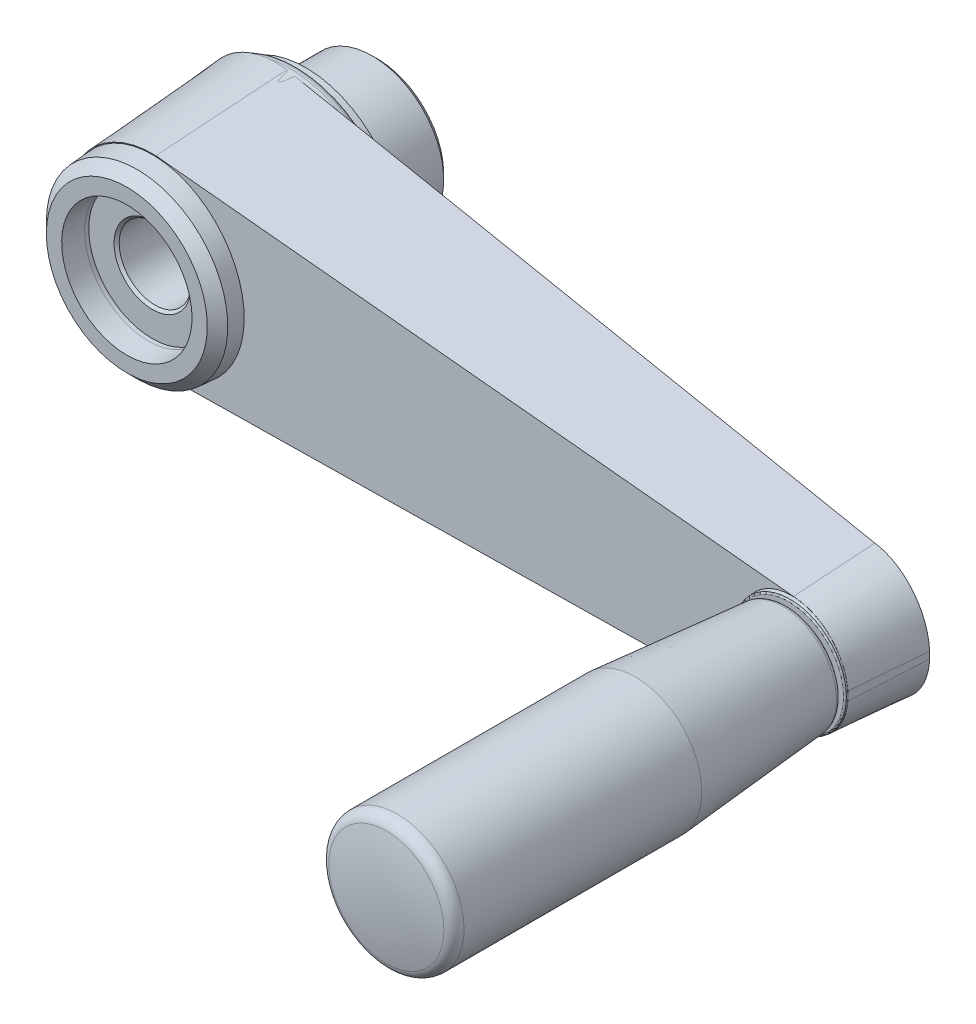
ISO-10303-21;
HEADER;
FILE_DESCRIPTION(('STEP AP214'),'2;1');
FILE_NAME('part.step','',(''),(''),'','','');
FILE_SCHEMA(('AUTOMOTIVE_DESIGN { 1 0 10303 214 1 1 1 1 }'));
ENDSEC;
DATA;
#1=APPLICATION_CONTEXT('core data for automotive mechanical design processes');
#2=APPLICATION_PROTOCOL_DEFINITION('international standard','automotive_design',2000,#1);
#3=PRODUCT_CONTEXT('',#1,'mechanical');
#4=PRODUCT('Part','Part','',(#3));
#5=PRODUCT_RELATED_PRODUCT_CATEGORY('part','',(#4));
#6=PRODUCT_DEFINITION_FORMATION('','',#4);
#7=PRODUCT_DEFINITION_CONTEXT('part definition',#1,'design');
#8=PRODUCT_DEFINITION('design','',#6,#7);
#9=PRODUCT_DEFINITION_SHAPE('','',#8);
#10=(LENGTH_UNIT() NAMED_UNIT(*) SI_UNIT(.MILLI.,.METRE.));
#11=(NAMED_UNIT(*) PLANE_ANGLE_UNIT() SI_UNIT($,.RADIAN.));
#12=(NAMED_UNIT(*) SI_UNIT($,.STERADIAN.) SOLID_ANGLE_UNIT());
#13=UNCERTAINTY_MEASURE_WITH_UNIT(LENGTH_MEASURE(1.E-05),#10,'distance_accuracy_value','');
#14=(GEOMETRIC_REPRESENTATION_CONTEXT(3) GLOBAL_UNCERTAINTY_ASSIGNED_CONTEXT((#13)) GLOBAL_UNIT_ASSIGNED_CONTEXT((#10,
#11,#12)) REPRESENTATION_CONTEXT('',''));
#15=CARTESIAN_POINT('',(0.,0.,0.));
#16=DIRECTION('',(0.,0.,1.));
#17=DIRECTION('',(1.,0.,0.));
#18=AXIS2_PLACEMENT_3D('',#15,#16,#17);
#19=CARTESIAN_POINT('',(0.,0.,49.));
#20=DIRECTION('',(0.,0.,1.));
#21=DIRECTION('',(-1.,0.,0.));
#22=AXIS2_PLACEMENT_3D('',#19,#20,#21);
#23=PLANE('',#22);
#24=CARTESIAN_POINT('',(0.,0.,49.));
#25=DIRECTION('',(0.,0.,1.));
#26=DIRECTION('',(-1.,0.,0.));
#27=AXIS2_PLACEMENT_3D('',#24,#25,#26);
#28=CIRCLE('',#27,15.7499999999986);
#29=CARTESIAN_POINT('',(-15.7499999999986,0.,49.));
#30=VERTEX_POINT('',#29);
#31=EDGE_CURVE('E125',#30,#30,#28,.T.);
#32=ORIENTED_EDGE('',*,*,#31,.T.);
#33=EDGE_LOOP('',(#32));
#34=FACE_BOUND('',#33,.T.);
#35=CARTESIAN_POINT('',(0.,0.,49.));
#36=DIRECTION('',(0.,0.,1.));
#37=DIRECTION('',(0.,-1.,0.));
#38=AXIS2_PLACEMENT_3D('',#35,#36,#37);
#39=CIRCLE('',#38,12.75);
#40=CARTESIAN_POINT('',(0.,-12.75,49.));
#41=VERTEX_POINT('',#40);
#42=EDGE_CURVE('E691',#41,#41,#39,.T.);
#43=ORIENTED_EDGE('',*,*,#42,.F.);
#44=EDGE_LOOP('',(#43));
#45=FACE_BOUND('',#44,.T.);
#46=ADVANCED_FACE('F14',(#34,#45),#23,.T.);
#47=CARTESIAN_POINT('',(-20.1321366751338,-20.,15.3848281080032));
#48=DIRECTION('',(-0.114070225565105,0.,0.993472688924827));
#49=DIRECTION('',(-0.993472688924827,0.,-0.114070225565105));
#50=AXIS2_PLACEMENT_3D('',#47,#48,#49);
#51=PLANE('',#50);
#52=DIRECTION('',(0.991730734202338,0.0591922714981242,0.113870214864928));
#53=VECTOR('',#52,1.);
#54=CARTESIAN_POINT('',(-20.0633459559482,-21.1677415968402,15.3927266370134));
#55=LINE('',#54,#53);
#56=CARTESIAN_POINT('',(129.969630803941,-12.2128989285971,32.6194664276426));
#57=VERTEX_POINT('',#56);
#58=CARTESIAN_POINT('',(1.75271123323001,-19.8656321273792,17.8976395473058));
#59=VERTEX_POINT('',#58);
#60=EDGE_CURVE('E328',#57,#59,#55,.F.);
#61=ORIENTED_EDGE('',*,*,#60,.T.);
#62=CARTESIAN_POINT('',(-0.172677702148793,0.,17.6765669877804));
#63=DIRECTION('',(-0.114070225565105,0.,0.993472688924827));
#64=DIRECTION('',(-0.993472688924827,0.,-0.114070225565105));
#65=AXIS2_PLACEMENT_3D('',#62,#63,#64);
#66=ELLIPSE('',#65,20.0905965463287,19.9587120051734);
#67=CARTESIAN_POINT('',(1.75271123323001,19.8656321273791,17.8976395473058));
#68=VERTEX_POINT('',#67);
#69=EDGE_CURVE('E212',#59,#68,#66,.T.);
#70=ORIENTED_EDGE('',*,*,#69,.T.);
#71=DIRECTION('',(-0.991730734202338,0.0591922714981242,-0.113870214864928));
#72=VECTOR('',#71,1.);
#73=CARTESIAN_POINT('',(-17.7152341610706,21.0275925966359,15.6623361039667));
#74=LINE('',#73,#72);
#75=CARTESIAN_POINT('',(129.969630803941,12.2128989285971,32.6194664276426));
#76=VERTEX_POINT('',#75);
#77=EDGE_CURVE('E324',#68,#76,#74,.F.);
#78=ORIENTED_EDGE('',*,*,#77,.T.);
#79=CARTESIAN_POINT('',(129.901938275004,0.,32.6116939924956));
#80=DIRECTION('',(-0.114070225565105,0.,0.993472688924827));
#81=DIRECTION('',(-0.993472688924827,0.,-0.114070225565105));
#82=AXIS2_PLACEMENT_3D('',#79,#80,#81);
#83=ELLIPSE('',#82,12.2937251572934,12.2130865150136);
#84=CARTESIAN_POINT('',(142.097777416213,0.656184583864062,34.0120164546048));
#85=VERTEX_POINT('',#84);
#86=EDGE_CURVE('E185',#76,#85,#83,.F.);
#87=ORIENTED_EDGE('',*,*,#86,.T.);
#88=DIRECTION('',(0.,1.,0.));
#89=VECTOR('',#88,1.);
#90=CARTESIAN_POINT('',(142.097777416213,-20.,34.0120164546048));
#91=LINE('',#90,#89);
#92=CARTESIAN_POINT('',(142.097777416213,-0.656184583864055,34.0120164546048));
#93=VERTEX_POINT('',#92);
#94=EDGE_CURVE('E311',#93,#85,#91,.T.);
#95=ORIENTED_EDGE('',*,*,#94,.F.);
#96=EDGE_CURVE('E351',#93,#57,#83,.F.);
#97=ORIENTED_EDGE('',*,*,#96,.T.);
#98=EDGE_LOOP('',(#61,#70,#78,#87,#95,#97));
#99=FACE_BOUND('',#98,.T.);
#100=ADVANCED_FACE('F151',(#99),#51,.F.);
#101=CARTESIAN_POINT('',(0.,0.,15.3848281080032));
#102=DIRECTION('',(0.,0.,-1.));
#103=DIRECTION('',(0.,1.,0.));
#104=AXIS2_PLACEMENT_3D('',#101,#102,#103);
#105=CONICAL_SURFACE('',#104,20.1321,0.0698131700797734);
#106=CARTESIAN_POINT('',(-0.051062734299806,0.,43.2844621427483));
#107=DIRECTION('',(-0.0401317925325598,0.,0.999194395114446));
#108=DIRECTION('',(-0.999194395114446,0.,-0.0401317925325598));
#109=AXIS2_PLACEMENT_3D('',#106,#107,#108);
#110=ELLIPSE('',#109,18.1958261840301,18.1810958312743);
#111=CARTESIAN_POINT('',(-0.0490638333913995,18.1810957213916,43.2845424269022));
#112=VERTEX_POINT('',#111);
#113=CARTESIAN_POINT('',(-18.0845323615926,2.31274383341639,42.5601631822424));
#114=VERTEX_POINT('',#113);
#115=EDGE_CURVE('E309',#112,#114,#110,.T.);
#116=ORIENTED_EDGE('',*,*,#115,.F.);
#117=CARTESIAN_POINT('',(-0.0586959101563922,17.7848123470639,48.9512203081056));
#118=CARTESIAN_POINT('',(-0.0492354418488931,18.1760435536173,43.3568222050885));
#119=CARTESIAN_POINT('',(-0.0396138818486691,18.5672664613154,37.762423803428));
#120=CARTESIAN_POINT('',(-0.0200485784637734,19.3496956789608,26.5736264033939));
#121=CARTESIAN_POINT('',(-0.0101048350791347,19.7409019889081,20.9792274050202));
#122=CARTESIAN_POINT('',(-1.80411241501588E-12,20.1321,15.3848281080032));
#123=B_SPLINE_CURVE_WITH_KNOTS('',3,(#117,#118,#119,#120,#121,#122),.UNSPECIFIED.,.F.,.F.,(4,2,
4),(0.,16.8242079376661,33.6484158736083),.UNSPECIFIED.);
#124=CARTESIAN_POINT('',(-0.0041620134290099,19.9704925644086,17.6959159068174));
#125=VERTEX_POINT('',#124);
#126=EDGE_CURVE('E374',#112,#125,#123,.T.);
#127=ORIENTED_EDGE('',*,*,#126,.T.);
#128=CARTESIAN_POINT('',(-0.160352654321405,0.,17.6779821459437));
#129=DIRECTION('',(-0.114070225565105,0.,0.993472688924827));
#130=DIRECTION('',(-0.993472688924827,0.,-0.114070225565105));
#131=AXIS2_PLACEMENT_3D('',#128,#129,#130);
#132=ELLIPSE('',#131,20.1029653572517,19.9711033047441);
#133=CARTESIAN_POINT('',(-0.0041620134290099,-19.9704925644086,17.6959159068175));
#134=VERTEX_POINT('',#133);
#135=EDGE_CURVE('E323',#125,#134,#132,.T.);
#136=ORIENTED_EDGE('',*,*,#135,.T.);
#137=CARTESIAN_POINT('',(-0.0586959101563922,-17.7848123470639,48.9512203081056));
#138=CARTESIAN_POINT('',(-0.0492354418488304,-18.1760435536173,43.3568222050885));
#139=CARTESIAN_POINT('',(-0.039613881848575,-18.5672664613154,37.762423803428));
#140=CARTESIAN_POINT('',(-0.0200485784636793,-19.3496956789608,26.5736264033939));
#141=CARTESIAN_POINT('',(-0.010104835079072,-19.7409019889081,20.9792274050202));
#142=CARTESIAN_POINT('',(-1.80411241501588E-12,-20.1321,15.3848281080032));
#143=B_SPLINE_CURVE_WITH_KNOTS('',3,(#137,#138,#139,#140,#141,#142),.UNSPECIFIED.,.F.,.F.,(4,2,
4),(0.,16.8242079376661,33.6484158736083),.UNSPECIFIED.);
#144=CARTESIAN_POINT('',(-0.0490638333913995,-18.1810957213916,43.2845424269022));
#145=VERTEX_POINT('',#144);
#146=EDGE_CURVE('E184',#145,#134,#143,.T.);
#147=ORIENTED_EDGE('',*,*,#146,.F.);
#148=CARTESIAN_POINT('',(-18.0845323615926,-2.31274383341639,42.5601631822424));
#149=VERTEX_POINT('',#148);
#150=EDGE_CURVE('E339',#149,#145,#110,.T.);
#151=ORIENTED_EDGE('',*,*,#150,.F.);
#152=CARTESIAN_POINT('',(-9.6901966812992,0.,153.967862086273));
#153=DIRECTION('',(0.997173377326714,0.,-0.0751349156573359));
#154=DIRECTION('',(-0.0751349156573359,0.,-0.997173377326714));
#155=AXIS2_PLACEMENT_3D('',#152,#153,#154);
#156=ELLIPSE('',#155,138.969081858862,3.88890136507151);
#157=EDGE_CURVE('E342',#149,#114,#156,.T.);
#158=ORIENTED_EDGE('',*,*,#157,.T.);
#159=EDGE_LOOP('',(#116,#127,#136,#147,#151,#158));
#160=FACE_BOUND('',#159,.T.);
#161=ADVANCED_FACE('F191',(#160),#105,.T.);
#162=CARTESIAN_POINT('',(0.,-20.1321,15.3848281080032));
#163=DIRECTION('',(0.0514517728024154,-0.996236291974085,0.0697564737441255));
#164=DIRECTION('',(0.,-0.069848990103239,-0.997557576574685));
#165=AXIS2_PLACEMENT_3D('',#162,#163,#164);
#166=PLANE('',#165);
#167=CARTESIAN_POINT('',(0.278755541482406,-19.9536063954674,17.7284004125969));
#168=VERTEX_POINT('',#167);
#169=EDGE_CURVE('E327',#168,#134,#55,.F.);
#170=ORIENTED_EDGE('',*,*,#169,.F.);
#171=CARTESIAN_POINT('',(0.27414150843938,-19.956133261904,17.6957159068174));
#172=CARTESIAN_POINT('',(0.299503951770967,-19.9423317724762,17.8741165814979));
#173=CARTESIAN_POINT('',(0.325702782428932,-19.9284865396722,18.0525250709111));
#174=CARTESIAN_POINT('',(0.381918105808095,-19.9005153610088,18.4105352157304));
#175=CARTESIAN_POINT('',(0.411969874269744,-19.8863879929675,18.5901311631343));
#176=CARTESIAN_POINT('',(0.48198191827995,-19.8560344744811,18.9719886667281));
#177=CARTESIAN_POINT('',(0.522728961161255,-19.8397795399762,19.1740809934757));
#178=CARTESIAN_POINT('',(0.615193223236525,-19.8069006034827,19.5754450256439));
#179=CARTESIAN_POINT('',(0.666841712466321,-19.7902794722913,19.7747264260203));
#180=CARTESIAN_POINT('',(0.757077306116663,-19.7690260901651,20.0117024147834));
#181=CARTESIAN_POINT('',(0.775616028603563,-19.7649116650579,20.0567891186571));
#182=CARTESIAN_POINT('',(0.817121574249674,-19.7566213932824,20.1445735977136));
#183=CARTESIAN_POINT('',(0.840037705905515,-19.7524467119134,20.1872921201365));
#184=CARTESIAN_POINT('',(0.876120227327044,-19.7469879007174,20.2386386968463));
#185=CARTESIAN_POINT('',(0.88492856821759,-19.7457198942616,20.2502509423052));
#186=CARTESIAN_POINT('',(0.903791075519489,-19.7431929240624,20.2724273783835));
#187=CARTESIAN_POINT('',(0.913842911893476,-19.7419339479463,20.2829934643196));
#188=CARTESIAN_POINT('',(0.931240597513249,-19.7399545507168,20.2984301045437));
#189=CARTESIAN_POINT('',(0.938058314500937,-19.7392203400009,20.3038871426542));
#190=CARTESIAN_POINT('',(0.95238235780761,-19.737784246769,20.3138316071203));
#191=CARTESIAN_POINT('',(0.959887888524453,-19.7370823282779,20.3183201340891));
#192=CARTESIAN_POINT('',(0.973750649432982,-19.7358983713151,20.3250039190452));
#193=CARTESIAN_POINT('',(0.979964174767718,-19.7354033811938,20.3274901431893));
#194=CARTESIAN_POINT('',(0.992717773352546,-19.7344703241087,20.3314087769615));
#195=CARTESIAN_POINT('',(0.999257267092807,-19.7340321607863,20.332842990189));
#196=CARTESIAN_POINT('',(1.01254548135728,-19.7332304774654,20.3344910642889));
#197=CARTESIAN_POINT('',(1.01929535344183,-19.732867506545,20.3346962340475));
#198=CARTESIAN_POINT('',(1.03271874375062,-19.7322346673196,20.3338332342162));
#199=CARTESIAN_POINT('',(1.03939220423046,-19.7319648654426,20.3327641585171));
#200=CARTESIAN_POINT('',(1.05330660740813,-19.7314901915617,20.3292801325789));
#201=CARTESIAN_POINT('',(1.06050751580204,-19.7312984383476,20.326707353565));
#202=CARTESIAN_POINT('',(1.07440250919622,-19.731019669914,20.3204397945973));
#203=CARTESIAN_POINT('',(1.08109555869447,-19.7309328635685,20.3167427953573));
#204=CARTESIAN_POINT('',(1.0982833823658,-19.7308125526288,20.3057834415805));
#205=CARTESIAN_POINT('',(1.10830866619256,-19.7308541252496,20.2977951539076));
#206=CARTESIAN_POINT('',(1.1271354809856,-19.7310926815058,20.2805016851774));
#207=CARTESIAN_POINT('',(1.1359331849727,-19.7312901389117,20.2711925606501));
#208=CARTESIAN_POINT('',(1.16974143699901,-19.7322911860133,20.2319592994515));
#209=CARTESIAN_POINT('',(1.19099956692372,-19.7335073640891,20.1989104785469));
#210=CARTESIAN_POINT('',(1.22948847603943,-19.7363053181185,20.1305620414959));
#211=CARTESIAN_POINT('',(1.2466872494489,-19.7378898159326,20.0952471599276));
#212=CARTESIAN_POINT('',(1.29897311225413,-19.7433958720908,19.9780460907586));
#213=CARTESIAN_POINT('',(1.32905558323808,-19.7477309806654,19.8939450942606));
#214=CARTESIAN_POINT('',(1.38381233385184,-19.7568031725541,19.7239912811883));
#215=CARTESIAN_POINT('',(1.4084704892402,-19.7615413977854,19.6381340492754));
#216=CARTESIAN_POINT('',(1.47745177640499,-19.7761038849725,19.3792779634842));
#217=CARTESIAN_POINT('',(1.51679496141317,-19.7862779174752,19.2049569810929));
#218=CARTESIAN_POINT('',(1.59906133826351,-19.8098372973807,18.8078116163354));
#219=CARTESIAN_POINT('',(1.64006948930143,-19.8233462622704,18.5846342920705));
#220=CARTESIAN_POINT('',(1.7154566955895,-19.8506156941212,18.1395773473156));
#221=CARTESIAN_POINT('',(1.74990079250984,-19.864372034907,17.9177086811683));
#222=CARTESIAN_POINT('',(1.7831485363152,-19.8781988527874,17.6957159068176));
#223=B_SPLINE_CURVE_WITH_KNOTS('',3,(#171,#172,#173,#174,#175,#176,#177,#178,#179,#180,#181,
#182,#183,#184,#185,#186,#187,#188,#189,#190,#191,#192,#193,#194,#195,#196,#197,#198,#199,#200,
#201,#202,#203,#204,#205,#206,#207,#208,#209,#210,#211,#212,#213,#214,#215,#216,#217,#218,#219,
#220,#221,#222),.UNSPECIFIED.,.F.,.F.,(4,2,2,2,2,2,2,2,2,2,2,2,2,2,2,2,2,2,2,2,2,2,2,2,2,4),(0.,
0.542405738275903,1.09018929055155,1.71097792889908,2.3279637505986,2.4746957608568,
2.61982163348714,2.66365918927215,2.70741581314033,2.73365148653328,2.75985718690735,
2.77991488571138,2.79993811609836,2.82010277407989,2.84028177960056,2.86310169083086,
2.8859669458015,2.92420546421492,2.96256064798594,3.07957561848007,3.19748447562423,
3.46505928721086,3.73341905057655,4.27001877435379,4.95191054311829,5.6266474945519),.UNSPECIFIED.);
#224=EDGE_CURVE('E204',#168,#59,#223,.T.);
#225=ORIENTED_EDGE('',*,*,#224,.T.);
#226=ORIENTED_EDGE('',*,*,#60,.F.);
#227=CARTESIAN_POINT('',(129.942336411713,-11.0707590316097,48.9512203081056));
#228=CARTESIAN_POINT('',(129.95354216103,-11.5520939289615,42.0687071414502));
#229=CARTESIAN_POINT('',(129.96512787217,-12.0334092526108,35.186193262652));
#230=CARTESIAN_POINT('',(129.984580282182,-12.815844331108,23.9973954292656));
#231=CARTESIAN_POINT('',(129.992215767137,-13.1169759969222,19.6911119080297));
#232=CARTESIAN_POINT('',(130.,-13.4181,15.3848281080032));
#233=B_SPLINE_CURVE_WITH_KNOTS('',3,(#227,#228,#229,#230,#231,#232),.UNSPECIFIED.,.F.,.F.,(4,2,
4),(0.,20.6979990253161,33.6484178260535),.UNSPECIFIED.);
#234=CARTESIAN_POINT('',(129.943060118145,-11.1019264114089,48.5055654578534));
#235=VERTEX_POINT('',#234);
#236=EDGE_CURVE('E177',#235,#57,#233,.T.);
#237=ORIENTED_EDGE('',*,*,#236,.F.);
#238=DIRECTION('',(0.99771839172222,0.054334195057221,0.0400725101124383));
#239=VECTOR('',#238,1.);
#240=CARTESIAN_POINT('',(-18.1298911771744,-19.1657495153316,42.5583413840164));
#241=LINE('',#240,#239);
#242=EDGE_CURVE('E344',#235,#145,#241,.F.);
#243=ORIENTED_EDGE('',*,*,#242,.T.);
#244=ORIENTED_EDGE('',*,*,#146,.T.);
#245=EDGE_LOOP('',(#170,#225,#226,#237,#243,#244));
#246=FACE_BOUND('',#245,.T.);
#247=ADVANCED_FACE('F187',(#246),#166,.T.);
#248=CARTESIAN_POINT('',(130.,13.4181,15.3848281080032));
#249=DIRECTION('',(0.0514517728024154,0.996236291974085,0.0697564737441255));
#250=DIRECTION('',(0.,-0.069848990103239,0.997557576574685));
#251=AXIS2_PLACEMENT_3D('',#248,#249,#250);
#252=PLANE('',#251);
#253=ORIENTED_EDGE('',*,*,#77,.F.);
#254=CARTESIAN_POINT('',(1.78314853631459,19.8781988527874,17.6957159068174));
#255=CARTESIAN_POINT('',(1.75649923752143,19.8670835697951,17.8741165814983));
#256=CARTESIAN_POINT('',(1.72901349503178,19.8560109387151,18.0525250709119));
#257=CARTESIAN_POINT('',(1.67021574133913,19.8339797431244,18.4105352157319));
#258=CARTESIAN_POINT('',(1.63886849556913,19.8230233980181,18.590131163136));
#259=CARTESIAN_POINT('',(1.56610200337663,19.8000438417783,18.9719886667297));
#260=CARTESIAN_POINT('',(1.52389721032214,19.7880730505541,19.174080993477));
#261=CARTESIAN_POINT('',(1.42853779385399,19.7648944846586,19.5754450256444));
#262=CARTESIAN_POINT('',(1.375451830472,19.7536824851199,19.7747264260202));
#263=CARTESIAN_POINT('',(1.28350686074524,19.7418380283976,20.0117024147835));
#264=CARTESIAN_POINT('',(1.26464291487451,19.7396553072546,20.0567891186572));
#265=CARTESIAN_POINT('',(1.22250415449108,19.7356849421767,20.1445735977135));
#266=CARTESIAN_POINT('',(1.19927988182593,19.7338932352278,20.1872921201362));
#267=CARTESIAN_POINT('',(1.16282698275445,19.7321805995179,20.2386386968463));
#268=CARTESIAN_POINT('',(1.15393487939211,19.7318267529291,20.2502509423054));
#269=CARTESIAN_POINT('',(1.13491240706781,19.7312563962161,20.2724273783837));
#270=CARTESIAN_POINT('',(1.12478435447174,19.7310396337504,20.2829934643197));
#271=CARTESIAN_POINT('',(1.10727531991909,19.7308630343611,20.2984301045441));
#272=CARTESIAN_POINT('',(1.10041823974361,19.7308350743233,20.3038871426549));
#273=CARTESIAN_POINT('',(1.0860224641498,19.7308822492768,20.3138316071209));
#274=CARTESIAN_POINT('',(1.07848455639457,19.7309572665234,20.3183201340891));
#275=CARTESIAN_POINT('',(1.0645735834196,19.7312077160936,20.3250039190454));
#276=CARTESIAN_POINT('',(1.058342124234,19.7313554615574,20.3274901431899));
#277=CARTESIAN_POINT('',(1.04556025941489,19.7317412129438,20.3314087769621));
#278=CARTESIAN_POINT('',(1.03901042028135,19.7319790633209,20.3328429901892));
#279=CARTESIAN_POINT('',(1.02571031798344,19.7325505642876,20.3344910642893));
#280=CARTESIAN_POINT('',(1.01895896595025,19.7328848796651,20.3346962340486));
#281=CARTESIAN_POINT('',(1.00554180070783,19.733638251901,20.3338332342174));
#282=CARTESIAN_POINT('',(0.998876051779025,19.7340573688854,20.3327641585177));
#283=CARTESIAN_POINT('',(0.984986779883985,19.7350186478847,20.3292801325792));
#284=CARTESIAN_POINT('',(0.977804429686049,19.7355697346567,20.3267073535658));
#285=CARTESIAN_POINT('',(0.963954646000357,19.7367238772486,20.3204397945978));
#286=CARTESIAN_POINT('',(0.957288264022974,19.7373270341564,20.3167427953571));
#287=CARTESIAN_POINT('',(0.940179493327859,19.7389780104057,20.3057834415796));
#288=CARTESIAN_POINT('',(0.9302118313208,19.7400521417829,20.2977951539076));
#289=CARTESIAN_POINT('',(0.91150975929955,19.7422289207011,20.2805016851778));
#290=CARTESIAN_POINT('',(0.902779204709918,19.7433316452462,20.27119256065));
#291=CARTESIAN_POINT('',(0.869253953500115,19.747810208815,20.2319592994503));
#292=CARTESIAN_POINT('',(0.848234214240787,19.751209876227,20.1989104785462));
#293=CARTESIAN_POINT('',(0.810238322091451,19.7579579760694,20.1305620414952));
#294=CARTESIAN_POINT('',(0.793294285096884,19.7613058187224,20.0952471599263));
#295=CARTESIAN_POINT('',(0.741853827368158,19.7721689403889,19.9780460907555));
#296=CARTESIAN_POINT('',(0.712378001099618,19.7795800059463,19.8939450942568));
#297=CARTESIAN_POINT('',(0.658847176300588,19.7942448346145,19.7239912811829));
#298=CARTESIAN_POINT('',(0.634808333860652,19.8014980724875,19.6381340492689));
#299=CARTESIAN_POINT('',(0.567694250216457,19.8230893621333,19.3792779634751));
#300=CARTESIAN_POINT('',(0.529608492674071,19.8372623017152,19.2049569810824));
#301=CARTESIAN_POINT('',(0.450206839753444,19.8691712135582,18.8078116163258));
#302=CARTESIAN_POINT('',(0.410808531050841,19.8868328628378,18.5846342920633));
#303=CARTESIAN_POINT('',(0.338631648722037,19.9217234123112,18.1395773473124));
#304=CARTESIAN_POINT('',(0.305787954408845,19.9389549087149,17.9177086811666));
#305=CARTESIAN_POINT('',(0.274141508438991,19.956133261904,17.6957159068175));
#306=B_SPLINE_CURVE_WITH_KNOTS('',3,(#254,#255,#256,#257,#258,#259,#260,#261,#262,#263,#264,
#265,#266,#267,#268,#269,#270,#271,#272,#273,#274,#275,#276,#277,#278,#279,#280,#281,#282,#283,
#284,#285,#286,#287,#288,#289,#290,#291,#292,#293,#294,#295,#296,#297,#298,#299,#300,#301,#302,
#303,#304,#305),.UNSPECIFIED.,.F.,.F.,(4,2,2,2,2,2,2,2,2,2,2,2,2,2,2,2,2,2,2,2,2,2,2,2,2,4),(0.,
0.542405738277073,1.09018929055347,1.71097792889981,2.32796375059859,2.47469576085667,
2.61982163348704,2.66365918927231,2.70741581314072,2.73365148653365,2.7598571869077,
2.77991488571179,2.79993811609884,2.82010277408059,2.84028177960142,2.86310169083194,
2.88596694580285,2.92420546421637,2.96256064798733,3.07957561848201,3.19748447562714,
3.4650592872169,3.73341905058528,4.27001877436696,4.9519105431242,5.62664749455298),.UNSPECIFIED.);
#307=CARTESIAN_POINT('',(0.278755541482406,19.9536063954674,17.7284004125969));
#308=VERTEX_POINT('',#307);
#309=EDGE_CURVE('E213',#68,#308,#306,.T.);
#310=ORIENTED_EDGE('',*,*,#309,.T.);
#311=EDGE_CURVE('E321',#125,#308,#74,.F.);
#312=ORIENTED_EDGE('',*,*,#311,.F.);
#313=ORIENTED_EDGE('',*,*,#126,.F.);
#314=DIRECTION('',(-0.99771839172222,0.054334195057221,-0.0400725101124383));
#315=VECTOR('',#314,1.);
#316=CARTESIAN_POINT('',(-15.9614821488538,19.047661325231,42.6454336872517));
#317=LINE('',#316,#315);
#318=CARTESIAN_POINT('',(129.943060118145,11.1019264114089,48.5055654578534));
#319=VERTEX_POINT('',#318);
#320=EDGE_CURVE('E347',#112,#319,#317,.F.);
#321=ORIENTED_EDGE('',*,*,#320,.T.);
#322=CARTESIAN_POINT('',(129.942336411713,11.0707590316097,48.9512203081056));
#323=CARTESIAN_POINT('',(129.95354216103,11.5520939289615,42.0687071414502));
#324=CARTESIAN_POINT('',(129.96512787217,12.0334092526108,35.186193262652));
#325=CARTESIAN_POINT('',(129.984580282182,12.815844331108,23.9973954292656));
#326=CARTESIAN_POINT('',(129.992215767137,13.1169759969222,19.6911119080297));
#327=CARTESIAN_POINT('',(130.,13.4181,15.3848281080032));
#328=B_SPLINE_CURVE_WITH_KNOTS('',3,(#322,#323,#324,#325,#326,#327),.UNSPECIFIED.,.F.,.F.,(4,2,
4),(0.,20.6979990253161,33.6484178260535),.UNSPECIFIED.);
#329=EDGE_CURVE('E170',#319,#76,#328,.T.);
#330=ORIENTED_EDGE('',*,*,#329,.T.);
#331=EDGE_LOOP('',(#253,#310,#312,#313,#321,#330));
#332=FACE_BOUND('',#331,.T.);
#333=ADVANCED_FACE('F164',(#332),#252,.T.);
#334=CARTESIAN_POINT('',(130.,0.,15.3848281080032));
#335=DIRECTION('',(0.,0.,-1.));
#336=DIRECTION('',(0.,-1.,0.));
#337=AXIS2_PLACEMENT_3D('',#334,#335,#336);
#338=CONICAL_SURFACE('',#337,13.4181,0.0698131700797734);
#339=CARTESIAN_POINT('',(136.665144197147,0.,110.658277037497));
#340=DIRECTION('',(0.997497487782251,0.,0.0707019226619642));
#341=DIRECTION('',(0.0707019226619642,0.,-0.997497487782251));
#342=AXIS2_PLACEMENT_3D('',#339,#340,#341);
#343=ELLIPSE('',#342,95.5551305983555,1.10383995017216);
#344=CARTESIAN_POINT('',(141.038897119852,-0.841297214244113,48.9512203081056));
#345=VERTEX_POINT('',#344);
#346=EDGE_CURVE('E320',#93,#345,#343,.F.);
#347=ORIENTED_EDGE('',*,*,#346,.T.);
#348=CARTESIAN_POINT('',(129.968819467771,0.,48.5066000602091));
#349=DIRECTION('',(-0.0401317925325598,0.,0.999194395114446));
#350=DIRECTION('',(-0.999194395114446,0.,-0.0401317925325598));
#351=AXIS2_PLACEMENT_3D('',#348,#349,#350);
#352=ELLIPSE('',#351,11.110951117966,11.1019562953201);
#353=EDGE_CURVE('E349',#345,#235,#352,.F.);
#354=ORIENTED_EDGE('',*,*,#353,.T.);
#355=ORIENTED_EDGE('',*,*,#236,.T.);
#356=ORIENTED_EDGE('',*,*,#96,.F.);
#357=EDGE_LOOP('',(#347,#354,#355,#356));
#358=FACE_BOUND('',#357,.T.);
#359=ADVANCED_FACE('F160',(#358),#338,.T.);
#360=ORIENTED_EDGE('',*,*,#329,.F.);
#361=CARTESIAN_POINT('',(141.038897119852,0.841297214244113,48.9512203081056));
#362=VERTEX_POINT('',#361);
#363=EDGE_CURVE('E350',#319,#362,#352,.F.);
#364=ORIENTED_EDGE('',*,*,#363,.T.);
#365=EDGE_CURVE('E313',#362,#85,#343,.F.);
#366=ORIENTED_EDGE('',*,*,#365,.T.);
#367=ORIENTED_EDGE('',*,*,#86,.F.);
#368=EDGE_LOOP('',(#360,#364,#366,#367));
#369=FACE_BOUND('',#368,.T.);
#370=ADVANCED_FACE('F150',(#369),#338,.T.);
#371=CARTESIAN_POINT('',(-18.328894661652,0.,15.5918757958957));
#372=CARTESIAN_POINT('',(-18.3314479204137,-0.0265989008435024,15.5915826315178));
#373=CARTESIAN_POINT('',(-18.3339440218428,-0.0532040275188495,15.591296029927));
#374=CARTESIAN_POINT('',(-18.3821774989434,-0.579479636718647,15.5857578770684));
#375=CARTESIAN_POINT('',(-18.4078121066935,-1.0812362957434,15.5828145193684));
#376=CARTESIAN_POINT('',(-18.4184458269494,-2.08568099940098,15.5815935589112));
#377=CARTESIAN_POINT('',(-18.4033955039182,-2.58836943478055,15.5833216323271));
#378=CARTESIAN_POINT('',(-18.3321200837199,-3.59724014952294,15.5915054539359));
#379=CARTESIAN_POINT('',(-18.2753742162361,-4.10338565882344,15.5980209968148));
#380=CARTESIAN_POINT('',(-18.1203713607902,-5.10938130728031,15.6158183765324));
#381=CARTESIAN_POINT('',(-18.0220988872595,-5.60922902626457,15.6271019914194));
#382=CARTESIAN_POINT('',(-17.7844864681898,-6.59952830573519,15.6543845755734));
#383=CARTESIAN_POINT('',(-17.6451011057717,-7.08996883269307,15.6703887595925));
#384=CARTESIAN_POINT('',(-17.3261714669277,-8.05743669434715,15.7070081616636));
#385=CARTESIAN_POINT('',(-17.1466272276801,-8.53446404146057,15.7276233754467));
#386=CARTESIAN_POINT('',(-16.7459466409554,-9.47781621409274,15.7736293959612));
#387=CARTESIAN_POINT('',(-16.5243013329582,-9.94392216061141,15.7990786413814));
#388=CARTESIAN_POINT('',(-16.0424652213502,-10.8555129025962,15.8544029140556));
#389=CARTESIAN_POINT('',(-15.782273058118,-11.3009969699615,15.884278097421));
#390=CARTESIAN_POINT('',(-15.2252149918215,-12.1678892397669,15.9482393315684));
#391=CARTESIAN_POINT('',(-14.9283615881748,-12.589305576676,15.9823239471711));
#392=CARTESIAN_POINT('',(-14.2999853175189,-13.4050523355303,16.0544739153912));
#393=CARTESIAN_POINT('',(-13.9684630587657,-13.7993832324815,16.0925391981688));
#394=CARTESIAN_POINT('',(-13.2766639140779,-14.5540326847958,16.1719713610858));
#395=CARTESIAN_POINT('',(-12.9167267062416,-14.9146657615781,16.2132992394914));
#396=CARTESIAN_POINT('',(-12.3550506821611,-15.4313953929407,16.2777907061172));
#397=CARTESIAN_POINT('',(-12.164187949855,-15.59960892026,16.2997055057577));
#398=CARTESIAN_POINT('',(-11.7754506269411,-15.9277295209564,16.3443402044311));
#399=CARTESIAN_POINT('',(-11.5775741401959,-16.087634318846,16.3670603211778));
#400=CARTESIAN_POINT('',(-10.974105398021,-16.5542655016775,16.4363504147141));
#401=CARTESIAN_POINT('',(-10.5585229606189,-16.8480475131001,16.4840674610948));
#402=CARTESIAN_POINT('',(-9.70381834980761,-17.3985817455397,16.5822043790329));
#403=CARTESIAN_POINT('',(-9.26469668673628,-17.6553347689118,16.6326241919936));
#404=CARTESIAN_POINT('',(-8.59415347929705,-18.0093228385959,16.7096157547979));
#405=CARTESIAN_POINT('',(-8.37036860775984,-18.1214078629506,16.7353106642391));
#406=CARTESIAN_POINT('',(-7.9183087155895,-18.3358293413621,16.7872160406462));
#407=CARTESIAN_POINT('',(-7.69003488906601,-18.4381683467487,16.8134263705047));
#408=CARTESIAN_POINT('',(-6.99896911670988,-18.7302796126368,16.8927743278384));
#409=CARTESIAN_POINT('',(-6.52986850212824,-18.9051801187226,16.9466363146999));
#410=CARTESIAN_POINT('',(-5.57777015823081,-19.2138014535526,17.05595595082));
#411=CARTESIAN_POINT('',(-5.09475303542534,-19.3474614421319,17.1114158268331));
#412=CARTESIAN_POINT('',(-4.11888351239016,-19.5719430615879,17.2234648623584));
#413=CARTESIAN_POINT('',(-3.62602889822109,-19.6627549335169,17.2800542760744));
#414=CARTESIAN_POINT('',(-3.1300677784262,-19.7314565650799,17.3370003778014));
#415=B_SPLINE_CURVE_WITH_KNOTS('',3,(#371,#372,#373,#374,#375,#376,#377,#378,#379,#380,#381,
#382,#383,#384,#385,#386,#387,#388,#389,#390,#391,#392,#393,#394,#395,#396,#397,#398,#399,#400,
#401,#402,#403,#404,#405,#406,#407,#408,#409,#410,#411,#412,#413,#414),.UNSPECIFIED.,.F.,.F.,(4,
2,2,2,2,2,2,2,2,2,2,2,2,2,2,2,2,2,2,2,2,4),(0.,0.0801702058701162,1.58549200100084,
3.09264370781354,4.61894651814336,6.14581900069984,7.67438455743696,9.20294869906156,
10.7513264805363,12.2997588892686,13.8476648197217,15.3955435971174,16.9271174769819,
17.6929729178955,18.4590370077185,19.9905499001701,21.5220296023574,22.2766312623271,
23.0310348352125,24.5396231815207,26.0504265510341,27.5615738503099),.UNSPECIFIED.);
#416=CARTESIAN_POINT('',(-18.4141672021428,-1.78001299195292,15.5820848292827));
#417=VERTEX_POINT('',#416);
#418=CARTESIAN_POINT('',(-4.3686460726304,-19.5126972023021,17.194787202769));
#419=VERTEX_POINT('',#418);
#420=EDGE_CURVE('E29',#417,#419,#415,.T.);
#421=ORIENTED_EDGE('',*,*,#420,.T.);
#422=EDGE_CURVE('E211',#419,#168,#66,.T.);
#423=ORIENTED_EDGE('',*,*,#422,.T.);
#424=ORIENTED_EDGE('',*,*,#169,.T.);
#425=ORIENTED_EDGE('',*,*,#135,.F.);
#426=ORIENTED_EDGE('',*,*,#311,.T.);
#427=CARTESIAN_POINT('',(-4.3686460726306,19.5126972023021,17.194787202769));
#428=VERTEX_POINT('',#427);
#429=EDGE_CURVE('E36',#308,#428,#66,.T.);
#430=ORIENTED_EDGE('',*,*,#429,.T.);
#431=CARTESIAN_POINT('',(-18.328894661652,0.,15.5918757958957));
#432=CARTESIAN_POINT('',(-18.3314479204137,0.0265989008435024,15.5915826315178));
#433=CARTESIAN_POINT('',(-18.3339440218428,0.0532040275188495,15.591296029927));
#434=CARTESIAN_POINT('',(-18.3821774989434,0.579479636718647,15.5857578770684));
#435=CARTESIAN_POINT('',(-18.4078121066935,1.0812362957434,15.5828145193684));
#436=CARTESIAN_POINT('',(-18.4184458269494,2.08568099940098,15.5815935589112));
#437=CARTESIAN_POINT('',(-18.4033955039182,2.58836943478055,15.5833216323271));
#438=CARTESIAN_POINT('',(-18.3321200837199,3.59724014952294,15.5915054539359));
#439=CARTESIAN_POINT('',(-18.2753742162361,4.10338565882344,15.5980209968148));
#440=CARTESIAN_POINT('',(-18.1203713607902,5.10938130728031,15.6158183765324));
#441=CARTESIAN_POINT('',(-18.0220988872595,5.60922902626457,15.6271019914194));
#442=CARTESIAN_POINT('',(-17.7844864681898,6.59952830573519,15.6543845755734));
#443=CARTESIAN_POINT('',(-17.6451011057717,7.08996883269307,15.6703887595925));
#444=CARTESIAN_POINT('',(-17.3261714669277,8.05743669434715,15.7070081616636));
#445=CARTESIAN_POINT('',(-17.1466272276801,8.53446404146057,15.7276233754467));
#446=CARTESIAN_POINT('',(-16.7459466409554,9.47781621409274,15.7736293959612));
#447=CARTESIAN_POINT('',(-16.5243013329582,9.94392216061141,15.7990786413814));
#448=CARTESIAN_POINT('',(-16.0424652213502,10.8555129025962,15.8544029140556));
#449=CARTESIAN_POINT('',(-15.782273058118,11.3009969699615,15.884278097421));
#450=CARTESIAN_POINT('',(-15.2252149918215,12.1678892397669,15.9482393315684));
#451=CARTESIAN_POINT('',(-14.9283615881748,12.589305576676,15.9823239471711));
#452=CARTESIAN_POINT('',(-14.2999853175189,13.4050523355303,16.0544739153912));
#453=CARTESIAN_POINT('',(-13.9684630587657,13.7993832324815,16.0925391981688));
#454=CARTESIAN_POINT('',(-13.2766639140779,14.5540326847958,16.1719713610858));
#455=CARTESIAN_POINT('',(-12.9167267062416,14.9146657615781,16.2132992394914));
#456=CARTESIAN_POINT('',(-12.3550506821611,15.4313953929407,16.2777907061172));
#457=CARTESIAN_POINT('',(-12.164187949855,15.59960892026,16.2997055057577));
#458=CARTESIAN_POINT('',(-11.7754506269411,15.9277295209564,16.3443402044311));
#459=CARTESIAN_POINT('',(-11.5775741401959,16.087634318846,16.3670603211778));
#460=CARTESIAN_POINT('',(-10.974105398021,16.5542655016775,16.4363504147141));
#461=CARTESIAN_POINT('',(-10.5585229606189,16.8480475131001,16.4840674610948));
#462=CARTESIAN_POINT('',(-9.70381834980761,17.3985817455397,16.5822043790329));
#463=CARTESIAN_POINT('',(-9.26469668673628,17.6553347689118,16.6326241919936));
#464=CARTESIAN_POINT('',(-8.59415347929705,18.0093228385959,16.7096157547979));
#465=CARTESIAN_POINT('',(-8.37036860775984,18.1214078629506,16.7353106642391));
#466=CARTESIAN_POINT('',(-7.9183087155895,18.3358293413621,16.7872160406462));
#467=CARTESIAN_POINT('',(-7.69003488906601,18.4381683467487,16.8134263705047));
#468=CARTESIAN_POINT('',(-6.99896911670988,18.7302796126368,16.8927743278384));
#469=CARTESIAN_POINT('',(-6.52986850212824,18.9051801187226,16.9466363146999));
#470=CARTESIAN_POINT('',(-5.57777015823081,19.2138014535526,17.05595595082));
#471=CARTESIAN_POINT('',(-5.09475303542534,19.3474614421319,17.1114158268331));
#472=CARTESIAN_POINT('',(-4.11888351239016,19.5719430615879,17.2234648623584));
#473=CARTESIAN_POINT('',(-3.62602889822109,19.6627549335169,17.2800542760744));
#474=CARTESIAN_POINT('',(-3.1300677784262,19.7314565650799,17.3370003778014));
#475=B_SPLINE_CURVE_WITH_KNOTS('',3,(#431,#432,#433,#434,#435,#436,#437,#438,#439,#440,#441,
#442,#443,#444,#445,#446,#447,#448,#449,#450,#451,#452,#453,#454,#455,#456,#457,#458,#459,#460,
#461,#462,#463,#464,#465,#466,#467,#468,#469,#470,#471,#472,#473,#474),.UNSPECIFIED.,.F.,.F.,(4,
2,2,2,2,2,2,2,2,2,2,2,2,2,2,2,2,2,2,2,2,4),(0.,0.0801702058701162,1.58549200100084,
3.09264370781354,4.61894651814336,6.14581900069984,7.67438455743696,9.20294869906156,
10.7513264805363,12.2997588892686,13.8476648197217,15.3955435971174,16.9271174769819,
17.6929729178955,18.4590370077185,19.9905499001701,21.5220296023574,22.2766312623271,
23.0310348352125,24.5396231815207,26.0504265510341,27.5615738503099),.UNSPECIFIED.);
#476=CARTESIAN_POINT('',(-18.4141672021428,1.78001299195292,15.5820848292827));
#477=VERTEX_POINT('',#476);
#478=EDGE_CURVE('E100',#428,#477,#475,.F.);
#479=ORIENTED_EDGE('',*,*,#478,.T.);
#480=CARTESIAN_POINT('',(0.,0.,17.6963937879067));
#481=DIRECTION('',(-0.114070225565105,0.,0.993472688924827));
#482=DIRECTION('',(0.993472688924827,0.,0.114070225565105));
#483=AXIS2_PLACEMENT_3D('',#480,#481,#482);
#484=ELLIPSE('',#483,18.6215486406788,18.4999999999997);
#485=EDGE_CURVE('E9',#417,#477,#484,.F.);
#486=ORIENTED_EDGE('',*,*,#485,.F.);
#487=EDGE_LOOP('',(#421,#423,#424,#425,#426,#430,#479,#486));
#488=FACE_BOUND('',#487,.T.);
#489=ADVANCED_FACE('F101',(#488),#51,.F.);
#490=CARTESIAN_POINT('',(141.038897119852,-20.,48.9512203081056));
#491=DIRECTION('',(0.997497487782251,0.,0.0707019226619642));
#492=DIRECTION('',(-0.0707019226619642,0.,0.997497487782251));
#493=AXIS2_PLACEMENT_3D('',#490,#491,#492);
#494=PLANE('',#493);
#495=ORIENTED_EDGE('',*,*,#346,.F.);
#496=ORIENTED_EDGE('',*,*,#94,.T.);
#497=ORIENTED_EDGE('',*,*,#365,.F.);
#498=DIRECTION('',(0.,1.,0.));
#499=VECTOR('',#498,1.);
#500=CARTESIAN_POINT('',(141.038897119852,-20.,48.9512203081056));
#501=LINE('',#500,#499);
#502=CARTESIAN_POINT('',(141.038897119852,0.,48.9512203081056));
#503=VERTEX_POINT('',#502);
#504=EDGE_CURVE('E334',#503,#362,#501,.T.);
#505=ORIENTED_EDGE('',*,*,#504,.F.);
#506=EDGE_CURVE('E314',#345,#503,#501,.T.);
#507=ORIENTED_EDGE('',*,*,#506,.F.);
#508=EDGE_LOOP('',(#495,#496,#497,#505,#507));
#509=FACE_BOUND('',#508,.T.);
#510=ADVANCED_FACE('F149',(#509),#494,.T.);
#511=CARTESIAN_POINT('',(-18.0845323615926,-20.,42.5601631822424));
#512=DIRECTION('',(-0.0401317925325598,0.,0.999194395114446));
#513=DIRECTION('',(-0.999194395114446,0.,-0.0401317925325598));
#514=AXIS2_PLACEMENT_3D('',#511,#512,#513);
#515=PLANE('',#514);
#516=DIRECTION('',(0.,1.,0.));
#517=VECTOR('',#516,1.);
#518=CARTESIAN_POINT('',(-18.0845323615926,-20.,42.5601631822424));
#519=LINE('',#518,#517);
#520=CARTESIAN_POINT('',(-18.0845323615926,0.,42.5601631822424));
#521=VERTEX_POINT('',#520);
#522=EDGE_CURVE('E307',#521,#114,#519,.T.);
#523=ORIENTED_EDGE('',*,*,#522,.F.);
#524=CARTESIAN_POINT('',(-0.0545638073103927,0.,43.2843215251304));
#525=DIRECTION('',(-0.0401317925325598,0.,0.999194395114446));
#526=DIRECTION('',(-0.999194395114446,0.,-0.0401317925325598));
#527=AXIS2_PLACEMENT_3D('',#524,#525,#526);
#528=ELLIPSE('',#527,18.0445052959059,18.0298859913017);
#529=EDGE_CURVE('E298',#521,#521,#528,.T.);
#530=ORIENTED_EDGE('',*,*,#529,.F.);
#531=EDGE_CURVE('E304',#149,#521,#519,.T.);
#532=ORIENTED_EDGE('',*,*,#531,.F.);
#533=ORIENTED_EDGE('',*,*,#150,.T.);
#534=ORIENTED_EDGE('',*,*,#242,.F.);
#535=ORIENTED_EDGE('',*,*,#353,.F.);
#536=ORIENTED_EDGE('',*,*,#506,.T.);
#537=CARTESIAN_POINT('',(129.96848467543,0.,48.5065866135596));
#538=DIRECTION('',(-0.0401317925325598,0.,0.999194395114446));
#539=DIRECTION('',(-0.999194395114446,0.,-0.0401317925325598));
#540=AXIS2_PLACEMENT_3D('',#537,#538,#539);
#541=ELLIPSE('',#540,11.0793380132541,11.0703675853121);
#542=EDGE_CURVE('E22',#503,#503,#541,.T.);
#543=ORIENTED_EDGE('',*,*,#542,.F.);
#544=ORIENTED_EDGE('',*,*,#504,.T.);
#545=ORIENTED_EDGE('',*,*,#363,.F.);
#546=ORIENTED_EDGE('',*,*,#320,.F.);
#547=ORIENTED_EDGE('',*,*,#115,.T.);
#548=EDGE_LOOP('',(#523,#530,#532,#533,#534,#535,#536,#543,#544,#545,#546,#547));
#549=FACE_BOUND('',#548,.T.);
#550=ADVANCED_FACE('F155',(#549),#515,.T.);
#551=CARTESIAN_POINT('',(-18.0845323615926,-20.,42.5601631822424));
#552=DIRECTION('',(0.997173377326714,0.,-0.0751349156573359));
#553=DIRECTION('',(0.0751349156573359,0.,0.997173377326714));
#554=AXIS2_PLACEMENT_3D('',#551,#552,#553);
#555=PLANE('',#554);
#556=ORIENTED_EDGE('',*,*,#157,.F.);
#557=ORIENTED_EDGE('',*,*,#531,.T.);
#558=ORIENTED_EDGE('',*,*,#522,.T.);
#559=EDGE_LOOP('',(#556,#557,#558));
#560=FACE_BOUND('',#559,.T.);
#561=ADVANCED_FACE('F16',(#560),#555,.F.);
#562=CARTESIAN_POINT('',(130.,0.,79.5));
#563=DIRECTION('',(0.,-1.,0.));
#564=DIRECTION('',(1.,0.,0.));
#565=AXIS2_PLACEMENT_3D('',#562,#563,#564);
#566=SPHERICAL_SURFACE('',#565,50.);
#567=CARTESIAN_POINT('',(130.,0.,79.5));
#568=DIRECTION('',(0.,0.,1.));
#569=DIRECTION('',(0.,-1.,0.));
#570=AXIS2_PLACEMENT_3D('',#567,#568,#569);
#571=SPHERICAL_SURFACE('',#570,50.);
#572=CARTESIAN_POINT('',(130.,0.,128.216426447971));
#573=DIRECTION('',(0.,0.,1.));
#574=DIRECTION('',(0.,-1.,0.));
#575=AXIS2_PLACEMENT_3D('',#572,#573,#574);
#576=CIRCLE('',#575,11.2565445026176);
#577=CARTESIAN_POINT('',(130.,-11.2565445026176,128.216426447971));
#578=VERTEX_POINT('',#577);
#579=EDGE_CURVE('E219',#578,#578,#576,.T.);
#580=ORIENTED_EDGE('',*,*,#579,.T.);
#581=EDGE_LOOP('',(#580));
#582=FACE_BOUND('',#581,.T.);
#583=ADVANCED_FACE('F282',(#582),#571,.T.);
#584=CARTESIAN_POINT('',(130.,0.,49.2212105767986));
#585=DIRECTION('',(0.,0.,-1.));
#586=DIRECTION('',(0.,1.,0.));
#587=AXIS2_PLACEMENT_3D('',#584,#585,#586);
#588=CONICAL_SURFACE('',#587,11.0197603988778,0.0707609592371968);
#589=ORIENTED_EDGE('',*,*,#542,.T.);
#590=EDGE_LOOP('',(#589));
#591=FACE_BOUND('',#590,.T.);
#592=CARTESIAN_POINT('',(130.,0.,49.2212105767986));
#593=DIRECTION('',(0.,0.,1.));
#594=DIRECTION('',(0.,-1.,0.));
#595=AXIS2_PLACEMENT_3D('',#592,#593,#594);
#596=CIRCLE('',#595,11.0197603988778);
#597=CARTESIAN_POINT('',(130.,-11.0197603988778,49.2212105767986));
#598=VERTEX_POINT('',#597);
#599=EDGE_CURVE('E375',#598,#598,#596,.T.);
#600=ORIENTED_EDGE('',*,*,#599,.F.);
#601=EDGE_LOOP('',(#600));
#602=FACE_BOUND('',#601,.T.);
#603=ADVANCED_FACE('F279',(#591,#602),#588,.T.);
#604=CARTESIAN_POINT('',(130.,0.,49.2));
#605=DIRECTION('',(0.,0.,1.));
#606=DIRECTION('',(0.,-1.,0.));
#607=AXIS2_PLACEMENT_3D('',#604,#605,#606);
#608=TOROIDAL_SURFACE('',#607,10.7205111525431,0.299999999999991);
#609=ORIENTED_EDGE('',*,*,#599,.T.);
#610=EDGE_LOOP('',(#609));
#611=FACE_BOUND('',#610,.T.);
#612=CARTESIAN_POINT('',(130.,0.,49.5));
#613=DIRECTION('',(0.,0.,1.));
#614=DIRECTION('',(0.,-1.,0.));
#615=AXIS2_PLACEMENT_3D('',#612,#613,#614);
#616=CIRCLE('',#615,10.7205111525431);
#617=CARTESIAN_POINT('',(130.,-10.7205111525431,49.5));
#618=VERTEX_POINT('',#617);
#619=EDGE_CURVE('E377',#618,#618,#616,.T.);
#620=ORIENTED_EDGE('',*,*,#619,.F.);
#621=EDGE_LOOP('',(#620));
#622=FACE_BOUND('',#621,.T.);
#623=ADVANCED_FACE('F275',(#611,#622),#608,.T.);
#624=CARTESIAN_POINT('',(140.720511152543,0.,49.5));
#625=DIRECTION('',(0.,0.,-1.));
#626=DIRECTION('',(0.,1.,0.));
#627=AXIS2_PLACEMENT_3D('',#624,#625,#626);
#628=PLANE('',#627);
#629=CARTESIAN_POINT('',(130.,0.,49.5));
#630=DIRECTION('',(0.,0.,1.));
#631=DIRECTION('',(0.,-1.,0.));
#632=AXIS2_PLACEMENT_3D('',#629,#630,#631);
#633=CIRCLE('',#632,6.);
#634=CARTESIAN_POINT('',(130.,-6.,49.5));
#635=VERTEX_POINT('',#634);
#636=EDGE_CURVE('E384',#635,#635,#633,.T.);
#637=ORIENTED_EDGE('',*,*,#636,.F.);
#638=EDGE_LOOP('',(#637));
#639=FACE_BOUND('',#638,.T.);
#640=ORIENTED_EDGE('',*,*,#619,.T.);
#641=EDGE_LOOP('',(#640));
#642=FACE_BOUND('',#641,.T.);
#643=ADVANCED_FACE('F271',(#639,#642),#628,.F.);
#644=CARTESIAN_POINT('',(130.,0.,134.195199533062));
#645=DIRECTION('',(0.,0.,1.));
#646=DIRECTION('',(0.,-1.,0.));
#647=AXIS2_PLACEMENT_3D('',#644,#645,#646);
#648=CYLINDRICAL_SURFACE('',#647,6.);
#649=ORIENTED_EDGE('',*,*,#636,.T.);
#650=EDGE_LOOP('',(#649));
#651=FACE_BOUND('',#650,.T.);
#652=CARTESIAN_POINT('',(130.,0.,49.8));
#653=DIRECTION('',(0.,0.,1.));
#654=DIRECTION('',(0.,-1.,0.));
#655=AXIS2_PLACEMENT_3D('',#652,#653,#654);
#656=CIRCLE('',#655,6.);
#657=CARTESIAN_POINT('',(130.,-6.,49.8));
#658=VERTEX_POINT('',#657);
#659=EDGE_CURVE('E389',#658,#658,#656,.T.);
#660=ORIENTED_EDGE('',*,*,#659,.F.);
#661=EDGE_LOOP('',(#660));
#662=FACE_BOUND('',#661,.T.);
#663=ADVANCED_FACE('F267',(#651,#662),#648,.T.);
#664=CARTESIAN_POINT('',(139.580638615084,0.,49.8));
#665=DIRECTION('',(0.,0.,-1.));
#666=DIRECTION('',(0.,1.,0.));
#667=AXIS2_PLACEMENT_3D('',#664,#665,#666);
#668=PLANE('',#667);
#669=ORIENTED_EDGE('',*,*,#659,.T.);
#670=EDGE_LOOP('',(#669));
#671=FACE_BOUND('',#670,.T.);
#672=CARTESIAN_POINT('',(130.,0.,49.8));
#673=DIRECTION('',(0.,0.,1.));
#674=DIRECTION('',(0.,-1.,0.));
#675=AXIS2_PLACEMENT_3D('',#672,#673,#674);
#676=CIRCLE('',#675,9.58063861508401);
#677=CARTESIAN_POINT('',(130.,-9.58063861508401,49.8));
#678=VERTEX_POINT('',#677);
#679=EDGE_CURVE('E392',#678,#678,#676,.T.);
#680=ORIENTED_EDGE('',*,*,#679,.F.);
#681=EDGE_LOOP('',(#680));
#682=FACE_BOUND('',#681,.T.);
#683=ADVANCED_FACE('F263',(#671,#682),#668,.T.);
#684=CARTESIAN_POINT('',(130.,0.,50.8));
#685=DIRECTION('',(0.,0.,1.));
#686=DIRECTION('',(0.,-1.,0.));
#687=AXIS2_PLACEMENT_3D('',#684,#685,#686);
#688=TOROIDAL_SURFACE('',#687,9.58063861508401,0.999999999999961);
#689=ORIENTED_EDGE('',*,*,#679,.T.);
#690=EDGE_LOOP('',(#689));
#691=FACE_BOUND('',#690,.T.);
#692=CARTESIAN_POINT('',(130.,0.,50.7161215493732));
#693=DIRECTION('',(0.,0.,1.));
#694=DIRECTION('',(0.,-1.,0.));
#695=AXIS2_PLACEMENT_3D('',#692,#693,#694);
#696=CIRCLE('',#695,10.5771146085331);
#697=CARTESIAN_POINT('',(130.,-10.5771146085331,50.7161215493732));
#698=VERTEX_POINT('',#697);
#699=EDGE_CURVE('E395',#698,#698,#696,.T.);
#700=ORIENTED_EDGE('',*,*,#699,.F.);
#701=EDGE_LOOP('',(#700));
#702=FACE_BOUND('',#701,.T.);
#703=ADVANCED_FACE('F259',(#691,#702),#688,.T.);
#704=CARTESIAN_POINT('',(130.,0.,50.7161215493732));
#705=DIRECTION('',(0.,0.,1.));
#706=DIRECTION('',(0.,-1.,0.));
#707=AXIS2_PLACEMENT_3D('',#704,#705,#706);
#708=CONICAL_SURFACE('',#707,10.5771146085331,0.0839771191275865);
#709=CARTESIAN_POINT('',(130.,0.,79.5));
#710=DIRECTION('',(0.,0.,1.));
#711=DIRECTION('',(0.,-1.,0.));
#712=AXIS2_PLACEMENT_3D('',#709,#710,#711);
#713=CIRCLE('',#712,13.);
#714=CARTESIAN_POINT('',(130.,-13.,79.5));
#715=VERTEX_POINT('',#714);
#716=EDGE_CURVE('E296',#715,#715,#713,.T.);
#717=ORIENTED_EDGE('',*,*,#716,.F.);
#718=EDGE_LOOP('',(#717));
#719=FACE_BOUND('',#718,.T.);
#720=ORIENTED_EDGE('',*,*,#699,.T.);
#721=EDGE_LOOP('',(#720));
#722=FACE_BOUND('',#721,.T.);
#723=ADVANCED_FACE('F255',(#719,#722),#708,.T.);
#724=CARTESIAN_POINT('',(130.,0.,134.195199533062));
#725=DIRECTION('',(0.,0.,1.));
#726=DIRECTION('',(0.,-1.,0.));
#727=AXIS2_PLACEMENT_3D('',#724,#725,#726);
#728=CYLINDRICAL_SURFACE('',#727,12.9999999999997);
#729=ORIENTED_EDGE('',*,*,#716,.T.);
#730=EDGE_LOOP('',(#729));
#731=FACE_BOUND('',#730,.T.);
#732=CARTESIAN_POINT('',(130.,0.,126.024187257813));
#733=DIRECTION('',(0.,0.,1.));
#734=DIRECTION('',(0.,-1.,0.));
#735=AXIS2_PLACEMENT_3D('',#732,#733,#734);
#736=CIRCLE('',#735,12.9999999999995);
#737=CARTESIAN_POINT('',(130.,-12.9999999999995,126.024187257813));
#738=VERTEX_POINT('',#737);
#739=EDGE_CURVE('E294',#738,#738,#736,.T.);
#740=ORIENTED_EDGE('',*,*,#739,.F.);
#741=EDGE_LOOP('',(#740));
#742=FACE_BOUND('',#741,.T.);
#743=ADVANCED_FACE('F251',(#731,#742),#728,.T.);
#744=CARTESIAN_POINT('',(130.,0.,126.024187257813));
#745=DIRECTION('',(0.,0.,1.));
#746=DIRECTION('',(0.,-1.,0.));
#747=AXIS2_PLACEMENT_3D('',#744,#745,#746);
#748=TOROIDAL_SURFACE('',#747,10.75,2.24999999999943);
#749=ORIENTED_EDGE('',*,*,#739,.T.);
#750=EDGE_LOOP('',(#749));
#751=FACE_BOUND('',#750,.T.);
#752=ORIENTED_EDGE('',*,*,#579,.F.);
#753=EDGE_LOOP('',(#752));
#754=FACE_BOUND('',#753,.T.);
#755=ADVANCED_FACE('F231',(#751,#754),#748,.T.);
#756=CARTESIAN_POINT('',(0.,0.,46.9999999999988));
#757=DIRECTION('',(0.,0.,-1.));
#758=DIRECTION('',(1.,0.,0.));
#759=AXIS2_PLACEMENT_3D('',#756,#757,#758);
#760=CONICAL_SURFACE('',#759,17.75,0.785398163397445);
#761=ORIENTED_EDGE('',*,*,#31,.F.);
#762=EDGE_LOOP('',(#761));
#763=FACE_BOUND('',#762,.T.);
#764=CARTESIAN_POINT('',(0.,0.,46.9999999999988));
#765=DIRECTION('',(0.,0.,1.));
#766=DIRECTION('',(-1.,0.,0.));
#767=AXIS2_PLACEMENT_3D('',#764,#765,#766);
#768=CIRCLE('',#767,17.75);
#769=CARTESIAN_POINT('',(-17.75,0.,46.9999999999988));
#770=VERTEX_POINT('',#769);
#771=EDGE_CURVE('E116',#770,#770,#768,.T.);
#772=ORIENTED_EDGE('',*,*,#771,.T.);
#773=EDGE_LOOP('',(#772));
#774=FACE_BOUND('',#773,.T.);
#775=ADVANCED_FACE('F225',(#763,#774),#760,.T.);
#776=CARTESIAN_POINT('',(0.,0.,46.9999999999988));
#777=DIRECTION('',(0.,0.,-1.));
#778=DIRECTION('',(1.,0.,0.));
#779=AXIS2_PLACEMENT_3D('',#776,#777,#778);
#780=CONICAL_SURFACE('',#779,17.75,0.0752057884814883);
#781=ORIENTED_EDGE('',*,*,#529,.T.);
#782=EDGE_LOOP('',(#781));
#783=FACE_BOUND('',#782,.T.);
#784=ORIENTED_EDGE('',*,*,#771,.F.);
#785=EDGE_LOOP('',(#784));
#786=FACE_BOUND('',#785,.T.);
#787=ADVANCED_FACE('F221',(#783,#786),#780,.T.);
#788=CARTESIAN_POINT('',(0.,0.,76.178685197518));
#789=DIRECTION('',(0.,0.,1.));
#790=DIRECTION('',(-1.,0.,0.));
#791=AXIS2_PLACEMENT_3D('',#788,#789,#790);
#792=CYLINDRICAL_SURFACE('',#791,18.4999999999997);
#793=CARTESIAN_POINT('',(0.,0.,14.));
#794=DIRECTION('',(0.,0.,1.));
#795=DIRECTION('',(-1.,0.,0.));
#796=AXIS2_PLACEMENT_3D('',#793,#794,#795);
#797=CIRCLE('',#796,18.4999999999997);
#798=CARTESIAN_POINT('',(-18.4999999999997,0.,14.));
#799=VERTEX_POINT('',#798);
#800=EDGE_CURVE('E114',#799,#799,#797,.T.);
#801=ORIENTED_EDGE('',*,*,#800,.T.);
#802=EDGE_LOOP('',(#801));
#803=FACE_BOUND('',#802,.T.);
#804=CARTESIAN_POINT('',(0.,0.,15.5820848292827));
#805=DIRECTION('',(0.,0.,1.));
#806=DIRECTION('',(-1.,0.,0.));
#807=AXIS2_PLACEMENT_3D('',#804,#805,#806);
#808=CIRCLE('',#807,18.4999999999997);
#809=EDGE_CURVE('E111',#417,#477,#808,.T.);
#810=ORIENTED_EDGE('',*,*,#809,.F.);
#811=ORIENTED_EDGE('',*,*,#485,.T.);
#812=EDGE_LOOP('',(#810,#811));
#813=FACE_BOUND('',#812,.T.);
#814=ADVANCED_FACE('F110',(#803,#813),#792,.T.);
#815=ORIENTED_EDGE('',*,*,#422,.F.);
#816=CARTESIAN_POINT('',(0.,0.,17.194787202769));
#817=DIRECTION('',(0.,0.,1.));
#818=DIRECTION('',(-1.,0.,0.));
#819=AXIS2_PLACEMENT_3D('',#816,#817,#818);
#820=CIRCLE('',#819,19.9957600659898);
#821=EDGE_CURVE('E113',#419,#428,#820,.T.);
#822=ORIENTED_EDGE('',*,*,#821,.T.);
#823=ORIENTED_EDGE('',*,*,#429,.F.);
#824=ORIENTED_EDGE('',*,*,#309,.F.);
#825=ORIENTED_EDGE('',*,*,#69,.F.);
#826=ORIENTED_EDGE('',*,*,#224,.F.);
#827=EDGE_LOOP('',(#815,#822,#823,#824,#825,#826));
#828=FACE_BOUND('',#827,.T.);
#829=ADVANCED_FACE('F227',(#828),#780,.T.);
#830=CARTESIAN_POINT('',(0.,0.,17.082084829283));
#831=DIRECTION('',(0.,0.,1.));
#832=DIRECTION('',(-1.,0.,0.));
#833=AXIS2_PLACEMENT_3D('',#830,#831,#832);
#834=TOROIDAL_SURFACE('',#833,18.4999999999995,1.50000000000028);
#835=ORIENTED_EDGE('',*,*,#420,.F.);
#836=ORIENTED_EDGE('',*,*,#809,.T.);
#837=ORIENTED_EDGE('',*,*,#478,.F.);
#838=ORIENTED_EDGE('',*,*,#821,.F.);
#839=EDGE_LOOP('',(#835,#836,#837,#838));
#840=FACE_BOUND('',#839,.T.);
#841=ADVANCED_FACE('F112',(#840),#834,.T.);
#842=CARTESIAN_POINT('',(0.,0.,76.178685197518));
#843=DIRECTION('',(0.,0.,1.));
#844=DIRECTION('',(-1.,0.,0.));
#845=AXIS2_PLACEMENT_3D('',#842,#843,#844);
#846=CYLINDRICAL_SURFACE('',#845,13.9999999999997);
#847=CARTESIAN_POINT('',(0.,0.,14.));
#848=DIRECTION('',(0.,0.,1.));
#849=DIRECTION('',(-1.,0.,0.));
#850=AXIS2_PLACEMENT_3D('',#847,#848,#849);
#851=CIRCLE('',#850,13.9999999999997);
#852=CARTESIAN_POINT('',(-13.9999999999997,0.,14.));
#853=VERTEX_POINT('',#852);
#854=EDGE_CURVE('E119',#853,#853,#851,.T.);
#855=ORIENTED_EDGE('',*,*,#854,.F.);
#856=EDGE_LOOP('',(#855));
#857=FACE_BOUND('',#856,.T.);
#858=CARTESIAN_POINT('',(0.,0.,1.));
#859=DIRECTION('',(0.,0.,1.));
#860=DIRECTION('',(-1.,0.,0.));
#861=AXIS2_PLACEMENT_3D('',#858,#859,#860);
#862=CIRCLE('',#861,13.9999999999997);
#863=CARTESIAN_POINT('',(-13.9999999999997,0.,1.00000000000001));
#864=VERTEX_POINT('',#863);
#865=EDGE_CURVE('E106',#864,#864,#862,.T.);
#866=ORIENTED_EDGE('',*,*,#865,.T.);
#867=EDGE_LOOP('',(#866));
#868=FACE_BOUND('',#867,.T.);
#869=ADVANCED_FACE('F244',(#857,#868),#846,.T.);
#870=CARTESIAN_POINT('',(0.,0.,1.));
#871=DIRECTION('',(0.,0.,1.));
#872=DIRECTION('',(-1.,0.,0.));
#873=AXIS2_PLACEMENT_3D('',#870,#871,#872);
#874=CONICAL_SURFACE('',#873,13.9999999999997,0.785398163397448);
#875=CARTESIAN_POINT('',(0.,0.,0.));
#876=DIRECTION('',(0.,0.,1.));
#877=DIRECTION('',(-1.,0.,0.));
#878=AXIS2_PLACEMENT_3D('',#875,#876,#877);
#879=CIRCLE('',#878,12.9999999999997);
#880=CARTESIAN_POINT('',(-12.9999999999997,0.,0.));
#881=VERTEX_POINT('',#880);
#882=EDGE_CURVE('E128',#881,#881,#879,.T.);
#883=ORIENTED_EDGE('',*,*,#882,.T.);
#884=EDGE_LOOP('',(#883));
#885=FACE_BOUND('',#884,.T.);
#886=ORIENTED_EDGE('',*,*,#865,.F.);
#887=EDGE_LOOP('',(#886));
#888=FACE_BOUND('',#887,.T.);
#889=ADVANCED_FACE('F240',(#885,#888),#874,.T.);
#890=CARTESIAN_POINT('',(-13.,0.,0.));
#891=DIRECTION('',(0.,0.,-1.));
#892=DIRECTION('',(1.,0.,0.));
#893=AXIS2_PLACEMENT_3D('',#890,#891,#892);
#894=PLANE('',#893);
#895=CARTESIAN_POINT('',(0.,0.,0.));
#896=DIRECTION('',(0.,0.,1.));
#897=DIRECTION('',(0.,-1.,0.));
#898=AXIS2_PLACEMENT_3D('',#895,#896,#897);
#899=CIRCLE('',#898,7.5);
#900=CARTESIAN_POINT('',(0.,-7.5,0.));
#901=VERTEX_POINT('',#900);
#902=EDGE_CURVE('E672',#901,#901,#899,.T.);
#903=ORIENTED_EDGE('',*,*,#902,.T.);
#904=EDGE_LOOP('',(#903));
#905=FACE_BOUND('',#904,.T.);
#906=ORIENTED_EDGE('',*,*,#882,.F.);
#907=EDGE_LOOP('',(#906));
#908=FACE_BOUND('',#907,.T.);
#909=ADVANCED_FACE('F236',(#905,#908),#894,.T.);
#910=CARTESIAN_POINT('',(-18.5,0.,14.));
#911=DIRECTION('',(0.,0.,-1.));
#912=DIRECTION('',(1.,0.,0.));
#913=AXIS2_PLACEMENT_3D('',#910,#911,#912);
#914=PLANE('',#913);
#915=ORIENTED_EDGE('',*,*,#854,.T.);
#916=EDGE_LOOP('',(#915));
#917=FACE_BOUND('',#916,.T.);
#918=ORIENTED_EDGE('',*,*,#800,.F.);
#919=EDGE_LOOP('',(#918));
#920=FACE_BOUND('',#919,.T.);
#921=ADVANCED_FACE('F239',(#917,#920),#914,.T.);
#922=CARTESIAN_POINT('',(0.,0.,44.8));
#923=DIRECTION('',(0.,0.,1.));
#924=DIRECTION('',(0.,-1.,0.));
#925=AXIS2_PLACEMENT_3D('',#922,#923,#924);
#926=CONICAL_SURFACE('',#925,12.4563073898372,0.0698131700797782);
#927=ORIENTED_EDGE('',*,*,#42,.T.);
#928=EDGE_LOOP('',(#927));
#929=FACE_BOUND('',#928,.T.);
#930=CARTESIAN_POINT('',(0.,0.,44.8));
#931=DIRECTION('',(0.,0.,1.));
#932=DIRECTION('',(0.,-1.,0.));
#933=AXIS2_PLACEMENT_3D('',#930,#931,#932);
#934=CIRCLE('',#933,12.4563073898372);
#935=CARTESIAN_POINT('',(0.,-12.4563073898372,44.8));
#936=VERTEX_POINT('',#935);
#937=EDGE_CURVE('E688',#936,#936,#934,.T.);
#938=ORIENTED_EDGE('',*,*,#937,.F.);
#939=EDGE_LOOP('',(#938));
#940=FACE_BOUND('',#939,.T.);
#941=ADVANCED_FACE('F567',(#929,#940),#926,.F.);
#942=CARTESIAN_POINT('',(0.,0.,50.));
#943=DIRECTION('',(0.,0.,1.));
#944=DIRECTION('',(0.,-1.,0.));
#945=AXIS2_PLACEMENT_3D('',#942,#943,#944);
#946=CYLINDRICAL_SURFACE('',#945,12.4563073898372);
#947=CARTESIAN_POINT('',(0.,0.,44.));
#948=DIRECTION('',(0.,0.,1.));
#949=DIRECTION('',(0.,-1.,0.));
#950=AXIS2_PLACEMENT_3D('',#947,#948,#949);
#951=CIRCLE('',#950,12.4563073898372);
#952=CARTESIAN_POINT('',(0.,-12.4563073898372,44.));
#953=VERTEX_POINT('',#952);
#954=EDGE_CURVE('E685',#953,#953,#951,.T.);
#955=ORIENTED_EDGE('',*,*,#954,.F.);
#956=EDGE_LOOP('',(#955));
#957=FACE_BOUND('',#956,.T.);
#958=ORIENTED_EDGE('',*,*,#937,.T.);
#959=EDGE_LOOP('',(#958));
#960=FACE_BOUND('',#959,.T.);
#961=ADVANCED_FACE('F577',(#957,#960),#946,.F.);
#962=CARTESIAN_POINT('',(-12.4563073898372,0.,44.));
#963=DIRECTION('',(0.,0.,-1.));
#964=DIRECTION('',(0.,1.,0.));
#965=AXIS2_PLACEMENT_3D('',#962,#963,#964);
#966=PLANE('',#965);
#967=CARTESIAN_POINT('',(0.,0.,44.));
#968=DIRECTION('',(0.,0.,1.));
#969=DIRECTION('',(0.,-1.,0.));
#970=AXIS2_PLACEMENT_3D('',#967,#968,#969);
#971=CIRCLE('',#970,7.5);
#972=CARTESIAN_POINT('',(0.,-7.5,44.));
#973=VERTEX_POINT('',#972);
#974=EDGE_CURVE('E679',#973,#973,#971,.T.);
#975=ORIENTED_EDGE('',*,*,#974,.F.);
#976=EDGE_LOOP('',(#975));
#977=FACE_BOUND('',#976,.T.);
#978=ORIENTED_EDGE('',*,*,#954,.T.);
#979=EDGE_LOOP('',(#978));
#980=FACE_BOUND('',#979,.T.);
#981=ADVANCED_FACE('F587',(#977,#980),#966,.F.);
#982=CARTESIAN_POINT('',(0.,0.,44.));
#983=DIRECTION('',(0.,0.,1.));
#984=DIRECTION('',(0.,-1.,0.));
#985=AXIS2_PLACEMENT_3D('',#982,#983,#984);
#986=CONICAL_SURFACE('',#985,7.5,0.785398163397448);
#987=CARTESIAN_POINT('',(0.,0.,43.5));
#988=DIRECTION('',(0.,0.,1.));
#989=DIRECTION('',(0.,-1.,0.));
#990=AXIS2_PLACEMENT_3D('',#987,#988,#989);
#991=CIRCLE('',#990,7.);
#992=CARTESIAN_POINT('',(0.,-7.,43.5));
#993=VERTEX_POINT('',#992);
#994=EDGE_CURVE('E676',#993,#993,#991,.T.);
#995=ORIENTED_EDGE('',*,*,#994,.F.);
#996=EDGE_LOOP('',(#995));
#997=FACE_BOUND('',#996,.T.);
#998=ORIENTED_EDGE('',*,*,#974,.T.);
#999=EDGE_LOOP('',(#998));
#1000=FACE_BOUND('',#999,.T.);
#1001=ADVANCED_FACE('F597',(#997,#1000),#986,.F.);
#1002=CARTESIAN_POINT('',(0.,0.,50.));
#1003=DIRECTION('',(0.,0.,1.));
#1004=DIRECTION('',(0.,-1.,0.));
#1005=AXIS2_PLACEMENT_3D('',#1002,#1003,#1004);
#1006=CYLINDRICAL_SURFACE('',#1005,7.);
#1007=CARTESIAN_POINT('',(0.,0.,0.500000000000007));
#1008=DIRECTION('',(0.,0.,1.));
#1009=DIRECTION('',(0.,-1.,0.));
#1010=AXIS2_PLACEMENT_3D('',#1007,#1008,#1009);
#1011=CIRCLE('',#1010,7.);
#1012=CARTESIAN_POINT('',(0.,-7.,0.500000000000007));
#1013=VERTEX_POINT('',#1012);
#1014=EDGE_CURVE('E675',#1013,#1013,#1011,.T.);
#1015=ORIENTED_EDGE('',*,*,#1014,.F.);
#1016=EDGE_LOOP('',(#1015));
#1017=FACE_BOUND('',#1016,.T.);
#1018=ORIENTED_EDGE('',*,*,#994,.T.);
#1019=EDGE_LOOP('',(#1018));
#1020=FACE_BOUND('',#1019,.T.);
#1021=ADVANCED_FACE('F607',(#1017,#1020),#1006,.F.);
#1022=CARTESIAN_POINT('',(0.,0.,0.500000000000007));
#1023=DIRECTION('',(0.,0.,-1.));
#1024=DIRECTION('',(0.,1.,0.));
#1025=AXIS2_PLACEMENT_3D('',#1022,#1023,#1024);
#1026=CONICAL_SURFACE('',#1025,7.,0.785398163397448);
#1027=ORIENTED_EDGE('',*,*,#902,.F.);
#1028=EDGE_LOOP('',(#1027));
#1029=FACE_BOUND('',#1028,.T.);
#1030=ORIENTED_EDGE('',*,*,#1014,.T.);
#1031=EDGE_LOOP('',(#1030));
#1032=FACE_BOUND('',#1031,.T.);
#1033=ADVANCED_FACE('F617',(#1029,#1032),#1026,.F.);
#1034=CLOSED_SHELL('',(#46,#100,#161,#247,#333,#359,#370,#489,#510,#550,#561,#583,#603,#623,
#643,#663,#683,#703,#723,#743,#755,#775,#787,#814,#829,#841,#869,#889,#909,#921,#941,#961,#981,
#1001,#1021,#1033));
#1035=MANIFOLD_SOLID_BREP('B1',#1034);
#1036=ADVANCED_BREP_SHAPE_REPRESENTATION('',(#18,#1035),#14);
#1037=SHAPE_DEFINITION_REPRESENTATION(#9,#1036);
ENDSEC;
END-ISO-10303-21;
